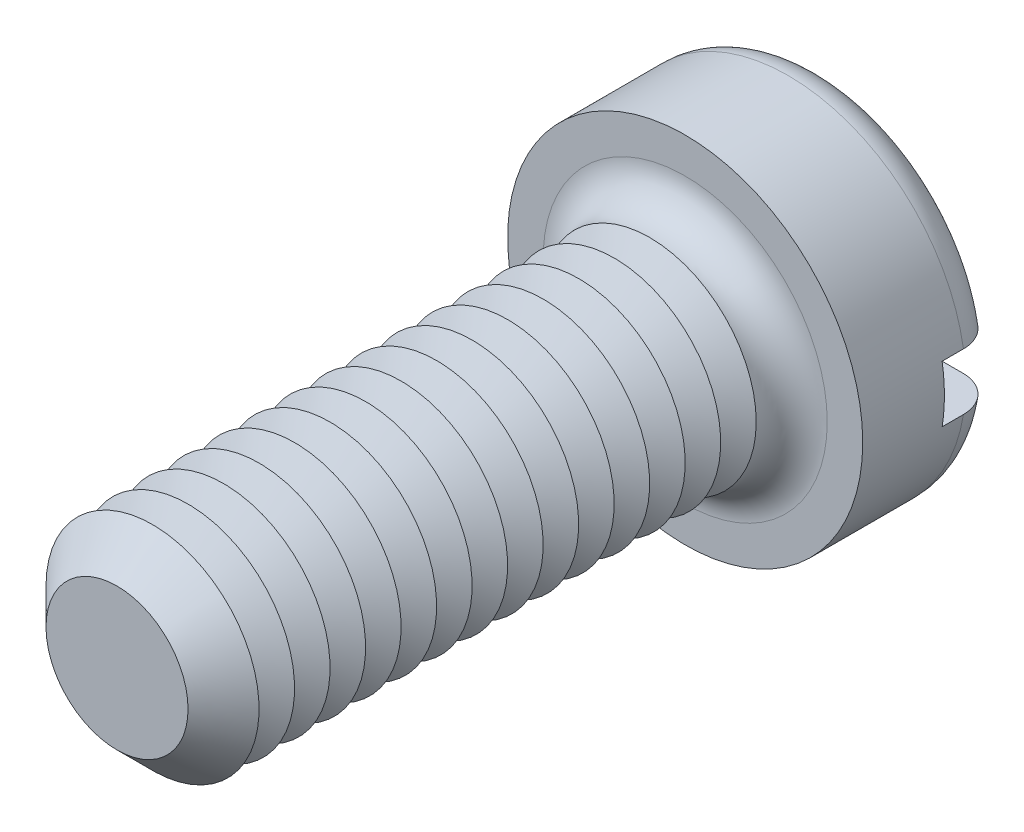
from build123d import *

# Parameters (mm, degrees)
SKETCH3_R           = 5
BOSS_EXTRUDE2_DEPTH = 3.9
SKETCH4_R           = 3
BOSS_EXTRUDE3_DEPTH = 16
FILLET1_R           = 1
CHAMFER1_SIZE       = 1
LPATTERN1_COUNT     = 14
LPATTERN1_PITCH     = 1
SKETCH8_W           = 10
SKETCH8_H           = 1.6
CUT_EXTRUDE1_DEPTH  = 1.6


with BuildPart() as part:
    # Sketch3 → Boss-Extrude2 (new body)
    with BuildSketch(Plane.XY):
        Circle(SKETCH3_R)
    extrude(amount=-BOSS_EXTRUDE2_DEPTH)

    # Sketch4 → Boss-Extrude3 (add)
    with BuildSketch(Plane.XY):
        Circle(SKETCH4_R)
    extrude(amount=BOSS_EXTRUDE3_DEPTH)

    # Fillet1
    fillet1_edges = [part.edges().sort_by_distance(p)[0] for p in [
        (-5, 0, -3.9),
        (-3, 0, 0),
    ]]
    fillet(fillet1_edges, radius=FILLET1_R)

    # Chamfer1
    chamfer1_edges = [part.edges().sort_by_distance(p)[0] for p in [
        (-3, 0, 16),
    ]]
    chamfer(chamfer1_edges, length=CHAMFER1_SIZE)

    # Sketch6 → Cut-Revolve1 (revolve, cut)
    with BuildSketch(Plane(origin=(0, 0, 0), x_dir=(0, 0, -1), z_dir=(1, 0, 0)), mode=Mode.PRIVATE) as cut_revolve1_sk:
        Polygon((-1, 3), (-1.5, 2.133974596), (-2, 3), align=None)
    cut_revolve1 = revolve(cut_revolve1_sk.sketch.rotate(Axis((0, 0, -1.694361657), (0, 0, 1)), 90), axis=Axis((0, 0, -1.694361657), (0, 0, 1)), mode=Mode.SUBTRACT)

    # LPattern1: Cut-Revolve1 ×14
    with Locations(*[(0, 0, i * LPATTERN1_PITCH) for i in range(1, LPATTERN1_COUNT)]):
        add(cut_revolve1, mode=Mode.SUBTRACT)

    # Sketch8 → Cut-Extrude1 (cut)
    with BuildSketch(Plane(origin=(0, 0, -3.9), x_dir=(-1, 0, 0), z_dir=(0, 0, -1))):
        Rectangle(SKETCH8_W, SKETCH8_H)
    extrude(amount=-CUT_EXTRUDE1_DEPTH, mode=Mode.SUBTRACT)


solid = part.part
